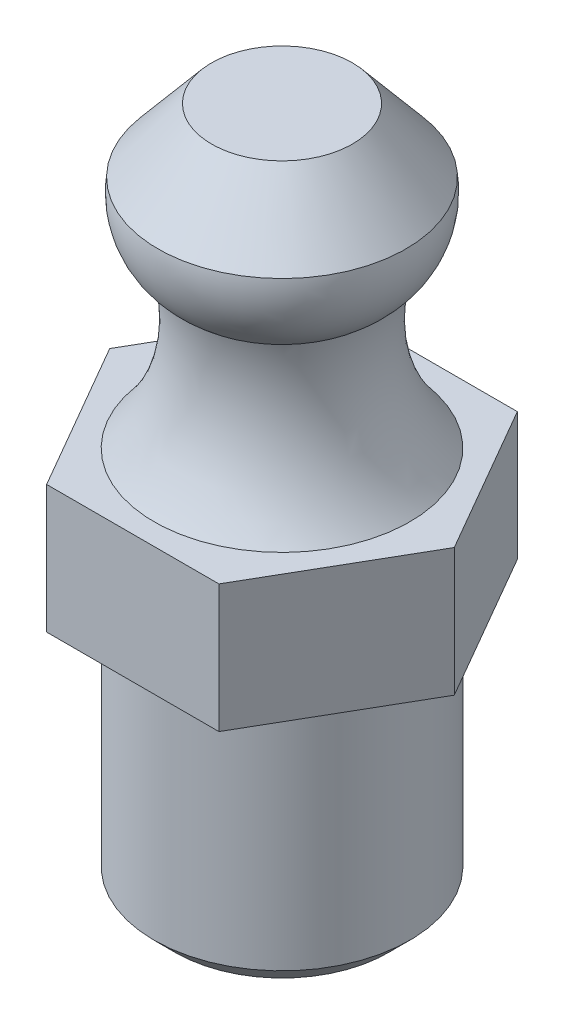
from build123d import *

# Parameters (mm, degrees)
ESQUISSE1_R      = 3
EXTRUSION1_DEPTH = 6
EXTRUSION2_DEPTH = 3
CHANFREIN1_SIZE  = 0.5


with BuildPart() as part:
    # Esquisse1 → Extrusion1 (new body)
    with BuildSketch(Plane(origin=(0, 0, 0), x_dir=(1, 0, 0), z_dir=(0, 1, 0))):
        with Locations(Location((0, 0, 0), (0, 0, 270))):
            Circle(ESQUISSE1_R)
    extrude(amount=-EXTRUSION1_DEPTH)

    # Esquisse2 → Extrusion2 (add)
    with BuildSketch(Plane(origin=(0, 0, 0), x_dir=(-1, 0, 0), z_dir=(0, 1, 0))):
        Polygon((-2.020725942, 3.5), (-4.041451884, 0), (-2.020725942, -3.5), (2.020725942, -3.5), (4.041451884, 0), (2.020725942, 3.5), align=None)
    extrude(amount=EXTRUSION2_DEPTH)

    # Esquisse3 → R_volution1 (revolve)
    with BuildSketch(Plane.XY, mode=Mode.PRIVATE) as r_volution1_sk:
        with BuildLine():
            Line((0, 10), (-1.651930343, 10))
            Line((-1.651930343, 10), (-2.91057979, 8.5))
            ThreePointArc((-2.91057979, 8.5), (-2.788112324, 7.461768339), (-2.158539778, 6.627165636))
            ThreePointArc((-2.158539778, 6.627165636), (-2.131486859, 4.709702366), (-3, 3))
            Line((-3, 3), (0, 3))
            Line((0, 3), (0, 10))
        make_face()
    revolve(r_volution1_sk.sketch.rotate(Axis((0, 0, 0), (0, 1, 0)), 270), axis=Axis((0, 0, 0), (0, 1, 0)))

    # Chanfrein1
    chanfrein1_edges = [part.edges().sort_by_distance(p)[0] for p in [
        (0, -6, -3),
    ]]
    chamfer(chanfrein1_edges, length=CHANFREIN1_SIZE)


solid = part.part
